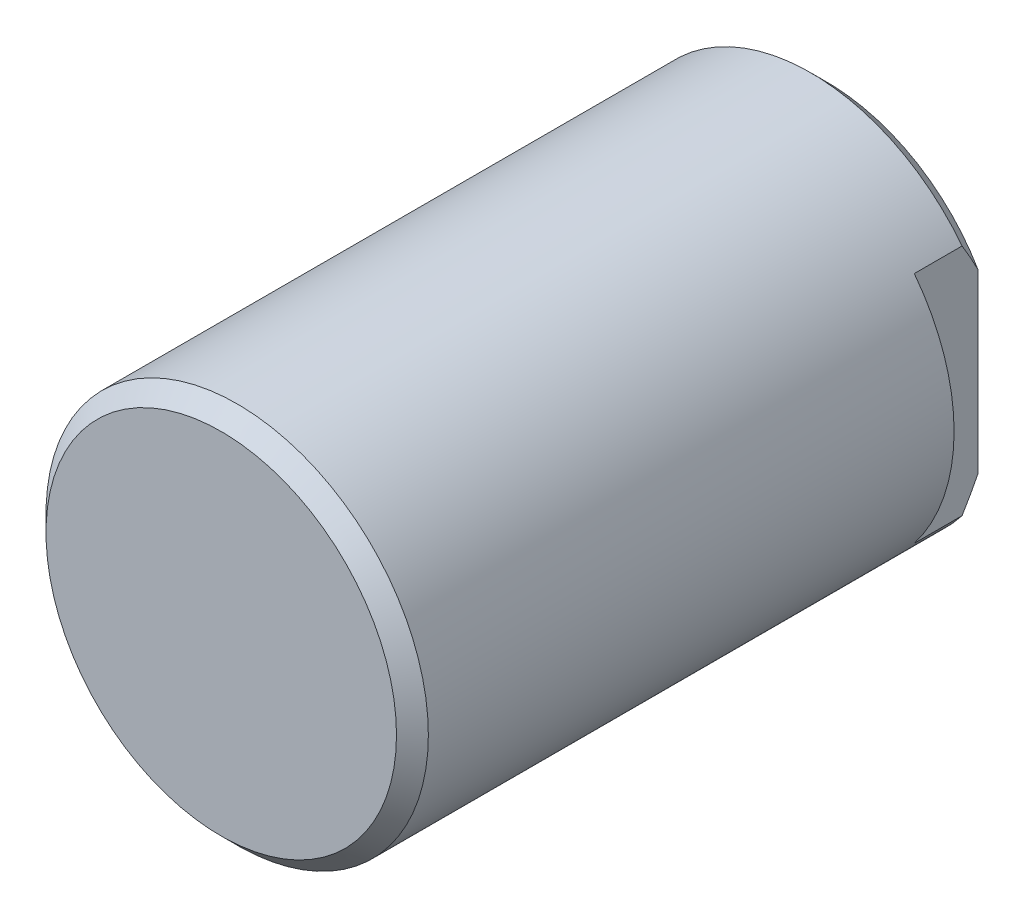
ISO-10303-21;
HEADER;
FILE_DESCRIPTION(('STEP AP214'),'2;1');
FILE_NAME('part.step','',(''),(''),'','','');
FILE_SCHEMA(('AUTOMOTIVE_DESIGN { 1 0 10303 214 1 1 1 1 }'));
ENDSEC;
DATA;
#1=APPLICATION_CONTEXT('core data for automotive mechanical design processes');
#2=APPLICATION_PROTOCOL_DEFINITION('international standard','automotive_design',2000,#1);
#3=PRODUCT_CONTEXT('',#1,'mechanical');
#4=PRODUCT('Part','Part','',(#3));
#5=PRODUCT_RELATED_PRODUCT_CATEGORY('part','',(#4));
#6=PRODUCT_DEFINITION_FORMATION('','',#4);
#7=PRODUCT_DEFINITION_CONTEXT('part definition',#1,'design');
#8=PRODUCT_DEFINITION('design','',#6,#7);
#9=PRODUCT_DEFINITION_SHAPE('','',#8);
#10=(LENGTH_UNIT() NAMED_UNIT(*) SI_UNIT(.MILLI.,.METRE.));
#11=(NAMED_UNIT(*) PLANE_ANGLE_UNIT() SI_UNIT($,.RADIAN.));
#12=(NAMED_UNIT(*) SI_UNIT($,.STERADIAN.) SOLID_ANGLE_UNIT());
#13=UNCERTAINTY_MEASURE_WITH_UNIT(LENGTH_MEASURE(1.E-05),#10,'distance_accuracy_value','');
#14=(GEOMETRIC_REPRESENTATION_CONTEXT(3) GLOBAL_UNCERTAINTY_ASSIGNED_CONTEXT((#13)) GLOBAL_UNIT_ASSIGNED_CONTEXT((#10,
#11,#12)) REPRESENTATION_CONTEXT('',''));
#15=CARTESIAN_POINT('',(0.,0.,0.));
#16=DIRECTION('',(0.,0.,1.));
#17=DIRECTION('',(1.,0.,0.));
#18=AXIS2_PLACEMENT_3D('',#15,#16,#17);
#19=CARTESIAN_POINT('',(0.,0.,0.));
#20=DIRECTION('',(0.,0.,1.));
#21=DIRECTION('',(1.,0.,0.));
#22=AXIS2_PLACEMENT_3D('',#19,#20,#21);
#23=CYLINDRICAL_SURFACE('',#22,6.);
#24=CARTESIAN_POINT('',(0.,0.,18.5));
#25=DIRECTION('',(0.,0.,1.));
#26=DIRECTION('',(1.,0.,0.));
#27=AXIS2_PLACEMENT_3D('',#24,#25,#26);
#28=CIRCLE('',#27,6.);
#29=CARTESIAN_POINT('',(6.,0.,18.5));
#30=VERTEX_POINT('',#29);
#31=EDGE_CURVE('E9',#30,#30,#28,.F.);
#32=ORIENTED_EDGE('',*,*,#31,.T.);
#33=EDGE_LOOP('',(#32));
#34=FACE_BOUND('',#33,.T.);
#35=DIRECTION('',(0.,0.,-1.));
#36=VECTOR('',#35,1.);
#37=CARTESIAN_POINT('',(-4.75,-3.6657195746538,2.));
#38=LINE('',#37,#36);
#39=CARTESIAN_POINT('',(-4.75,-3.6657195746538,2.));
#40=VERTEX_POINT('',#39);
#41=CARTESIAN_POINT('',(-4.75,-3.6657195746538,0.5));
#42=VERTEX_POINT('',#41);
#43=EDGE_CURVE('E180',#40,#42,#38,.T.);
#44=ORIENTED_EDGE('',*,*,#43,.T.);
#45=CARTESIAN_POINT('',(0.,0.,0.5));
#46=DIRECTION('',(0.,0.,-1.));
#47=DIRECTION('',(-1.,0.,0.));
#48=AXIS2_PLACEMENT_3D('',#45,#46,#47);
#49=CIRCLE('',#48,6.);
#50=CARTESIAN_POINT('',(4.75,-3.6657195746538,0.5));
#51=VERTEX_POINT('',#50);
#52=EDGE_CURVE('E175',#42,#51,#49,.F.);
#53=ORIENTED_EDGE('',*,*,#52,.T.);
#54=DIRECTION('',(0.,0.,-1.));
#55=VECTOR('',#54,1.);
#56=CARTESIAN_POINT('',(4.75,-3.6657195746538,2.));
#57=LINE('',#56,#55);
#58=CARTESIAN_POINT('',(4.75,-3.6657195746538,2.));
#59=VERTEX_POINT('',#58);
#60=EDGE_CURVE('E76',#59,#51,#57,.T.);
#61=ORIENTED_EDGE('',*,*,#60,.F.);
#62=CARTESIAN_POINT('',(0.,0.,2.));
#63=DIRECTION('',(0.,0.,-1.));
#64=DIRECTION('',(-1.,0.,0.));
#65=AXIS2_PLACEMENT_3D('',#62,#63,#64);
#66=CIRCLE('',#65,6.);
#67=CARTESIAN_POINT('',(4.75,3.6657195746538,2.));
#68=VERTEX_POINT('',#67);
#69=EDGE_CURVE('E81',#68,#59,#66,.T.);
#70=ORIENTED_EDGE('',*,*,#69,.F.);
#71=DIRECTION('',(0.,0.,-1.));
#72=VECTOR('',#71,1.);
#73=CARTESIAN_POINT('',(4.75,3.6657195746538,2.));
#74=LINE('',#73,#72);
#75=CARTESIAN_POINT('',(4.75,3.6657195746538,0.5));
#76=VERTEX_POINT('',#75);
#77=EDGE_CURVE('E66',#68,#76,#74,.T.);
#78=ORIENTED_EDGE('',*,*,#77,.T.);
#79=CARTESIAN_POINT('',(-4.75,3.6657195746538,0.5));
#80=VERTEX_POINT('',#79);
#81=EDGE_CURVE('E177',#76,#80,#49,.F.);
#82=ORIENTED_EDGE('',*,*,#81,.T.);
#83=DIRECTION('',(0.,0.,-1.));
#84=VECTOR('',#83,1.);
#85=CARTESIAN_POINT('',(-4.75,3.6657195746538,2.));
#86=LINE('',#85,#84);
#87=CARTESIAN_POINT('',(-4.75,3.6657195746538,2.));
#88=VERTEX_POINT('',#87);
#89=EDGE_CURVE('E36',#88,#80,#86,.T.);
#90=ORIENTED_EDGE('',*,*,#89,.F.);
#91=EDGE_CURVE('E86',#40,#88,#66,.T.);
#92=ORIENTED_EDGE('',*,*,#91,.F.);
#93=EDGE_LOOP('',(#44,#53,#61,#70,#78,#82,#90,#92));
#94=FACE_BOUND('',#93,.T.);
#95=ADVANCED_FACE('F14',(#34,#94),#23,.T.);
#96=CARTESIAN_POINT('',(0.,0.,0.));
#97=DIRECTION('',(0.,0.,-1.));
#98=DIRECTION('',(-1.,0.,0.));
#99=AXIS2_PLACEMENT_3D('',#96,#97,#98);
#100=PLANE('',#99);
#101=CARTESIAN_POINT('',(0.,0.,0.));
#102=DIRECTION('',(0.,0.,-1.));
#103=DIRECTION('',(-1.,0.,0.));
#104=AXIS2_PLACEMENT_3D('',#101,#102,#103);
#105=CIRCLE('',#104,5.5);
#106=CARTESIAN_POINT('',(4.75,-2.77263412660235,0.));
#107=VERTEX_POINT('',#106);
#108=CARTESIAN_POINT('',(-4.75,-2.77263412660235,0.));
#109=VERTEX_POINT('',#108);
#110=EDGE_CURVE('E174',#107,#109,#105,.T.);
#111=ORIENTED_EDGE('',*,*,#110,.T.);
#112=DIRECTION('',(0.,1.,0.));
#113=VECTOR('',#112,1.);
#114=CARTESIAN_POINT('',(-4.75,3.6657195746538,0.));
#115=LINE('',#114,#113);
#116=CARTESIAN_POINT('',(-4.75,2.77263412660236,0.));
#117=VERTEX_POINT('',#116);
#118=EDGE_CURVE('E82',#109,#117,#115,.T.);
#119=ORIENTED_EDGE('',*,*,#118,.T.);
#120=CARTESIAN_POINT('',(4.75,2.77263412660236,0.));
#121=VERTEX_POINT('',#120);
#122=EDGE_CURVE('E172',#117,#121,#105,.T.);
#123=ORIENTED_EDGE('',*,*,#122,.T.);
#124=DIRECTION('',(0.,-1.,0.));
#125=VECTOR('',#124,1.);
#126=CARTESIAN_POINT('',(4.75,3.6657195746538,0.));
#127=LINE('',#126,#125);
#128=EDGE_CURVE('E28',#121,#107,#127,.T.);
#129=ORIENTED_EDGE('',*,*,#128,.T.);
#130=EDGE_LOOP('',(#111,#119,#123,#129));
#131=FACE_BOUND('',#130,.T.);
#132=ADVANCED_FACE('F117',(#131),#100,.T.);
#133=CARTESIAN_POINT('',(0.,0.,0.));
#134=DIRECTION('',(0.,0.,1.));
#135=DIRECTION('',(1.,0.,0.));
#136=AXIS2_PLACEMENT_3D('',#133,#134,#135);
#137=CONICAL_SURFACE('',#136,5.5,0.785398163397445);
#138=ORIENTED_EDGE('',*,*,#52,.F.);
#139=CARTESIAN_POINT('',(-4.75,-7.89169974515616,3.71094049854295));
#140=CARTESIAN_POINT('',(-4.75,-7.69093683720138,3.53897428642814));
#141=CARTESIAN_POINT('',(-4.75,-7.48934475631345,3.36796190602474));
#142=CARTESIAN_POINT('',(-4.75,-7.08402963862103,3.02839521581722));
#143=CARTESIAN_POINT('',(-4.75,-6.88030615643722,2.85984143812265));
#144=CARTESIAN_POINT('',(-4.75,-6.46899973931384,2.52472348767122));
#145=CARTESIAN_POINT('',(-4.75,-6.26140027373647,2.35817954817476));
#146=CARTESIAN_POINT('',(-4.75,-5.84307115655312,2.02909534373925));
#147=CARTESIAN_POINT('',(-4.75,-5.63234177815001,1.86655473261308));
#148=CARTESIAN_POINT('',(-4.75,-5.21550995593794,1.55307966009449));
#149=CARTESIAN_POINT('',(-4.75,-5.00956146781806,1.40194123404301));
#150=CARTESIAN_POINT('',(-4.75,-4.59314137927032,1.10590470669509));
#151=CARTESIAN_POINT('',(-4.75,-4.38266891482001,0.961007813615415));
#152=CARTESIAN_POINT('',(-4.75,-3.95655813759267,0.679906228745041));
#153=CARTESIAN_POINT('',(-4.75,-3.74093088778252,0.543684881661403));
#154=CARTESIAN_POINT('',(-4.75,-3.30285613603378,0.282765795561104));
#155=CARTESIAN_POINT('',(-4.75,-3.08041196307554,0.158062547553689));
#156=CARTESIAN_POINT('',(-4.75,-2.6606770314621,-0.0580954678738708));
#157=CARTESIAN_POINT('',(-4.75,-2.46452403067,-0.151740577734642));
#158=CARTESIAN_POINT('',(-4.75,-2.06570924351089,-0.323383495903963));
#159=CARTESIAN_POINT('',(-4.75,-1.86305913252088,-0.401407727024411));
#160=CARTESIAN_POINT('',(-4.75,-1.55241999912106,-0.503726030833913));
#161=CARTESIAN_POINT('',(-4.75,-1.4469031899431,-0.535570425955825));
#162=CARTESIAN_POINT('',(-4.75,-1.23426699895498,-0.593326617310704));
#163=CARTESIAN_POINT('',(-4.75,-1.12714797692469,-0.619239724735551));
#164=CARTESIAN_POINT('',(-4.75,-0.910843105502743,-0.664618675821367));
#165=CARTESIAN_POINT('',(-4.75,-0.80164854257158,-0.684043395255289));
#166=CARTESIAN_POINT('',(-4.75,-0.582128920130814,-0.715704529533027));
#167=CARTESIAN_POINT('',(-4.75,-0.471802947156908,-0.727934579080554));
#168=CARTESIAN_POINT('',(-4.75,-0.361149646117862,-0.736290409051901));
#169=B_SPLINE_CURVE_WITH_KNOTS('',3,(#139,#140,#141,#142,#143,#144,#145,#146,#147,#148,#149,
#150,#151,#152,#153,#154,#155,#156,#157,#158,#159,#160,#161,#162,#163,#164,#165,#166,#167,#168),
.UNSPECIFIED.,.F.,.F.,(4,2,2,2,2,2,2,2,2,2,2,2,2,2,4),(0.,0.793044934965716,1.58625903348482,
2.38466300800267,3.18299769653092,3.94927751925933,4.71570501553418,5.48061377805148,
6.24515477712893,6.89676867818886,7.54727088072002,7.87778083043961,8.20821764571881,
8.54071074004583,8.87349755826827),.UNSPECIFIED.);
#170=EDGE_CURVE('E87',#42,#109,#169,.T.);
#171=ORIENTED_EDGE('',*,*,#170,.T.);
#172=ORIENTED_EDGE('',*,*,#110,.F.);
#173=CARTESIAN_POINT('',(4.75,-0.361149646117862,-0.736290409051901));
#174=CARTESIAN_POINT('',(4.75,-0.439189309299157,-0.730380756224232));
#175=CARTESIAN_POINT('',(4.75,-0.517068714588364,-0.722562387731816));
#176=CARTESIAN_POINT('',(4.75,-0.672351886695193,-0.703268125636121));
#177=CARTESIAN_POINT('',(4.75,-0.749755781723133,-0.691793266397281));
#178=CARTESIAN_POINT('',(4.75,-0.980739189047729,-0.652176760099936));
#179=CARTESIAN_POINT('',(4.75,-1.13344425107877,-0.618815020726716));
#180=CARTESIAN_POINT('',(4.75,-1.43384064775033,-0.540405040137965));
#181=CARTESIAN_POINT('',(4.75,-1.58156971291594,-0.495497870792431));
#182=CARTESIAN_POINT('',(4.75,-1.87363880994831,-0.395671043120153));
#183=CARTESIAN_POINT('',(4.75,-2.01797766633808,-0.340747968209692));
#184=CARTESIAN_POINT('',(4.75,-2.219389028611,-0.257355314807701));
#185=CARTESIAN_POINT('',(4.75,-2.27790796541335,-0.232302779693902));
#186=CARTESIAN_POINT('',(4.75,-2.39436332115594,-0.180907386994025));
#187=CARTESIAN_POINT('',(4.75,-2.45229986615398,-0.154564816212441));
#188=CARTESIAN_POINT('',(4.75,-2.56781660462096,-0.100595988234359));
#189=CARTESIAN_POINT('',(4.75,-2.62539485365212,-0.0729655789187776));
#190=CARTESIAN_POINT('',(4.75,-2.74000449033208,-0.0166031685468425));
#191=CARTESIAN_POINT('',(4.75,-2.79703590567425,0.0121287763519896));
#192=CARTESIAN_POINT('',(4.75,-3.08858543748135,0.162266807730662));
#193=CARTESIAN_POINT('',(4.75,-3.31894812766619,0.291793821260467));
#194=CARTESIAN_POINT('',(4.75,-3.77241352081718,0.563053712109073));
#195=CARTESIAN_POINT('',(4.75,-3.99551159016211,0.704794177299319));
#196=CARTESIAN_POINT('',(4.75,-4.43649667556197,0.997519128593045));
#197=CARTESIAN_POINT('',(4.75,-4.65436595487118,1.14853019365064));
#198=CARTESIAN_POINT('',(4.75,-5.08534212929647,1.4570537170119));
#199=CARTESIAN_POINT('',(4.75,-5.29845013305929,1.61456463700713));
#200=CARTESIAN_POINT('',(4.75,-5.71436758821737,1.92957970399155));
#201=CARTESIAN_POINT('',(4.75,-5.91729162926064,2.0869331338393));
#202=CARTESIAN_POINT('',(4.75,-6.3202903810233,2.40527179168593));
#203=CARTESIAN_POINT('',(4.75,-6.52036485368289,2.56625732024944));
#204=CARTESIAN_POINT('',(4.75,-6.91674689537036,2.88992607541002));
#205=CARTESIAN_POINT('',(4.75,-7.11307118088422,3.05258888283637));
#206=CARTESIAN_POINT('',(4.75,-7.50375445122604,3.38018460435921));
#207=CARTESIAN_POINT('',(4.75,-7.69811380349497,3.54511707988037));
#208=CARTESIAN_POINT('',(4.75,-7.89169974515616,3.71094049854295));
#209=B_SPLINE_CURVE_WITH_KNOTS('',3,(#173,#174,#175,#176,#177,#178,#179,#180,#181,#182,#183,
#184,#185,#186,#187,#188,#189,#190,#191,#192,#193,#194,#195,#196,#197,#198,#199,#200,#201,#202,
#203,#204,#205,#206,#207,#208),.UNSPECIFIED.,.F.,.F.,(4,2,2,2,2,2,2,2,2,2,2,2,2,2,2,2,2,4),(0.,
0.234738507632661,0.46941067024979,0.937694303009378,1.40050754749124,1.86347896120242,
2.05443728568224,2.24535334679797,2.43693447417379,2.62850584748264,3.42071585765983,
4.21342164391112,5.00851712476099,5.80342549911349,6.57372765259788,7.34409378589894,
8.10894205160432,8.87364454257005),.UNSPECIFIED.);
#210=EDGE_CURVE('E145',#107,#51,#209,.T.);
#211=ORIENTED_EDGE('',*,*,#210,.T.);
#212=EDGE_LOOP('',(#138,#171,#172,#211));
#213=FACE_BOUND('',#212,.T.);
#214=ADVANCED_FACE('F123',(#213),#137,.T.);
#215=ORIENTED_EDGE('',*,*,#122,.F.);
#216=CARTESIAN_POINT('',(-4.75,0.361149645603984,-0.736290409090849));
#217=CARTESIAN_POINT('',(-4.75,0.439189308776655,-0.73038075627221));
#218=CARTESIAN_POINT('',(-4.75,0.517068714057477,-0.722562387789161));
#219=CARTESIAN_POINT('',(-4.75,0.672351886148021,-0.703268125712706));
#220=CARTESIAN_POINT('',(-4.75,0.749755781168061,-0.691793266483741));
#221=CARTESIAN_POINT('',(-4.75,0.980739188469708,-0.652176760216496));
#222=CARTESIAN_POINT('',(-4.75,1.13344425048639,-0.618815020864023));
#223=CARTESIAN_POINT('',(-4.75,1.43384064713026,-0.540405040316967));
#224=CARTESIAN_POINT('',(-4.75,1.58156971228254,-0.495497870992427));
#225=CARTESIAN_POINT('',(-4.75,1.87363880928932,-0.395671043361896));
#226=CARTESIAN_POINT('',(-4.75,2.01797766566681,-0.340747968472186));
#227=CARTESIAN_POINT('',(-4.75,2.21938902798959,-0.257355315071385));
#228=CARTESIAN_POINT('',(-4.75,2.27790796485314,-0.232302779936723));
#229=CARTESIAN_POINT('',(-4.75,2.39436332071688,-0.180907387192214));
#230=CARTESIAN_POINT('',(-4.75,2.4522998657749,-0.154564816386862));
#231=CARTESIAN_POINT('',(-4.75,2.56781660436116,-0.100595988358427));
#232=CARTESIAN_POINT('',(-4.75,2.62539485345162,-0.0729655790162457));
#233=CARTESIAN_POINT('',(-4.75,2.74000449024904,-0.0166031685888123));
#234=CARTESIAN_POINT('',(-4.75,2.79703590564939,0.0121287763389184));
#235=CARTESIAN_POINT('',(-4.75,3.08858543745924,0.16226680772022));
#236=CARTESIAN_POINT('',(-4.75,3.3189481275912,0.291793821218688));
#237=CARTESIAN_POINT('',(-4.75,3.77241352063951,0.563053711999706));
#238=CARTESIAN_POINT('',(-4.75,3.99551158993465,0.704794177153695));
#239=CARTESIAN_POINT('',(-4.75,4.43649667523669,0.997519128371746));
#240=CARTESIAN_POINT('',(-4.75,4.65436595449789,1.1485301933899));
#241=CARTESIAN_POINT('',(-4.75,5.08534212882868,1.45705371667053));
#242=CARTESIAN_POINT('',(-4.75,5.29845013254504,1.61456463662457));
#243=CARTESIAN_POINT('',(-4.75,5.71436758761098,1.92957970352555));
#244=CARTESIAN_POINT('',(-4.75,5.9172916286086,2.08693313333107));
#245=CARTESIAN_POINT('',(-4.75,6.32029038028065,2.40527179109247));
#246=CARTESIAN_POINT('',(-4.75,6.52036485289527,2.566257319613));
#247=CARTESIAN_POINT('',(-4.75,6.91674689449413,2.88992607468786));
#248=CARTESIAN_POINT('',(-4.75,7.11307117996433,3.05258888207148));
#249=CARTESIAN_POINT('',(-4.75,7.50375445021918,3.38018460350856));
#250=CARTESIAN_POINT('',(-4.75,7.69811380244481,3.5451170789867));
#251=CARTESIAN_POINT('',(-4.75,7.89169974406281,3.71094049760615));
#252=B_SPLINE_CURVE_WITH_KNOTS('',3,(#216,#217,#218,#219,#220,#221,#222,#223,#224,#225,#226,
#227,#228,#229,#230,#231,#232,#233,#234,#235,#236,#237,#238,#239,#240,#241,#242,#243,#244,#245,
#246,#247,#248,#249,#250,#251),.UNSPECIFIED.,.F.,.F.,(4,2,2,2,2,2,2,2,2,2,2,2,2,2,2,2,2,4),(0.,
0.234738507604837,0.469410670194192,0.93769430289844,1.40050754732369,1.8634789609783,
2.05443728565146,2.24535334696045,2.43693447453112,2.62850584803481,3.42071585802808,
4.21342164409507,5.00851712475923,5.80342549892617,6.57372765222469,7.34409378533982,
8.10894205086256,8.87364454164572),.UNSPECIFIED.);
#253=EDGE_CURVE('E90',#117,#80,#252,.T.);
#254=ORIENTED_EDGE('',*,*,#253,.T.);
#255=ORIENTED_EDGE('',*,*,#81,.F.);
#256=CARTESIAN_POINT('',(4.75,7.8916997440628,3.71094049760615));
#257=CARTESIAN_POINT('',(4.75,7.69093683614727,3.53897428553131));
#258=CARTESIAN_POINT('',(4.75,7.48934475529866,3.36796190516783));
#259=CARTESIAN_POINT('',(4.75,7.08402963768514,3.02839521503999));
#260=CARTESIAN_POINT('',(4.75,6.88030615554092,2.85984143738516));
#261=CARTESIAN_POINT('',(4.75,6.46899973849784,2.52472348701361));
#262=CARTESIAN_POINT('',(4.75,6.26140027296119,2.35817954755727));
#263=CARTESIAN_POINT('',(4.75,5.84307115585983,2.02909534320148));
#264=CARTESIAN_POINT('',(4.75,5.63234177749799,1.86655473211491));
#265=CARTESIAN_POINT('',(4.75,5.21550995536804,1.55307965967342));
#266=CARTESIAN_POINT('',(4.75,5.00956146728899,1.40194123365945));
#267=CARTESIAN_POINT('',(4.75,4.5931413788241,1.10590470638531));
#268=CARTESIAN_POINT('',(4.75,4.38266891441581,0.961007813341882));
#269=CARTESIAN_POINT('',(4.75,3.95655813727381,0.679906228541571));
#270=CARTESIAN_POINT('',(4.75,3.74093088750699,0.543684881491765));
#271=CARTESIAN_POINT('',(4.75,3.30285613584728,0.282765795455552));
#272=CARTESIAN_POINT('',(4.75,3.08041196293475,0.158062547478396));
#273=CARTESIAN_POINT('',(4.75,2.6606770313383,-0.0580954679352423));
#274=CARTESIAN_POINT('',(4.75,2.4645240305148,-0.151740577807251));
#275=CARTESIAN_POINT('',(4.75,2.06570924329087,-0.323383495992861));
#276=CARTESIAN_POINT('',(4.75,1.86305913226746,-0.401407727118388));
#277=CARTESIAN_POINT('',(4.75,1.55241999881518,-0.503726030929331));
#278=CARTESIAN_POINT('',(4.75,1.44690318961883,-0.535570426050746));
#279=CARTESIAN_POINT('',(4.75,1.23426699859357,-0.593326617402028));
#280=CARTESIAN_POINT('',(4.75,1.12714797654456,-0.619239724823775));
#281=CARTESIAN_POINT('',(4.75,0.910843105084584,-0.664618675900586));
#282=CARTESIAN_POINT('',(4.75,0.801648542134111,-0.684043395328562));
#283=CARTESIAN_POINT('',(4.75,0.582128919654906,-0.715704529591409));
#284=CARTESIAN_POINT('',(4.75,0.471802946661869,-0.727934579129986));
#285=CARTESIAN_POINT('',(4.75,0.361149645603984,-0.736290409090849));
#286=B_SPLINE_CURVE_WITH_KNOTS('',3,(#256,#257,#258,#259,#260,#261,#262,#263,#264,#265,#266,
#267,#268,#269,#270,#271,#272,#273,#274,#275,#276,#277,#278,#279,#280,#281,#282,#283,#284,#285),
.UNSPECIFIED.,.F.,.F.,(4,2,2,2,2,2,2,2,2,2,2,2,2,2,4),(0.,0.793044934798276,1.58625903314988,
2.38466300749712,3.18299769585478,3.94927751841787,4.71570501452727,5.48061377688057,
6.2451547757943,6.89676867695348,7.54727087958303,7.87778082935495,8.20821764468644,
8.5407107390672,8.87349755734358),.UNSPECIFIED.);
#287=EDGE_CURVE('E71',#76,#121,#286,.T.);
#288=ORIENTED_EDGE('',*,*,#287,.T.);
#289=EDGE_LOOP('',(#215,#254,#255,#288));
#290=FACE_BOUND('',#289,.T.);
#291=ADVANCED_FACE('F129',(#290),#137,.T.);
#292=CARTESIAN_POINT('',(4.75,3.6657195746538,2.));
#293=DIRECTION('',(1.,0.,0.));
#294=DIRECTION('',(0.,-1.,0.));
#295=AXIS2_PLACEMENT_3D('',#292,#293,#294);
#296=PLANE('',#295);
#297=ORIENTED_EDGE('',*,*,#128,.F.);
#298=ORIENTED_EDGE('',*,*,#287,.F.);
#299=ORIENTED_EDGE('',*,*,#77,.F.);
#300=DIRECTION('',(0.,-1.,0.));
#301=VECTOR('',#300,1.);
#302=CARTESIAN_POINT('',(4.75,3.6657195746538,2.));
#303=LINE('',#302,#301);
#304=EDGE_CURVE('E69',#68,#59,#303,.T.);
#305=ORIENTED_EDGE('',*,*,#304,.T.);
#306=ORIENTED_EDGE('',*,*,#60,.T.);
#307=ORIENTED_EDGE('',*,*,#210,.F.);
#308=EDGE_LOOP('',(#297,#298,#299,#305,#306,#307));
#309=FACE_BOUND('',#308,.T.);
#310=ADVANCED_FACE('F68',(#309),#296,.T.);
#311=CARTESIAN_POINT('',(0.,0.,2.));
#312=DIRECTION('',(0.,0.,-1.));
#313=DIRECTION('',(-1.,0.,0.));
#314=AXIS2_PLACEMENT_3D('',#311,#312,#313);
#315=PLANE('',#314);
#316=ORIENTED_EDGE('',*,*,#69,.T.);
#317=ORIENTED_EDGE('',*,*,#304,.F.);
#318=EDGE_LOOP('',(#316,#317));
#319=FACE_BOUND('',#318,.T.);
#320=ADVANCED_FACE('F80',(#319),#315,.T.);
#321=ORIENTED_EDGE('',*,*,#91,.T.);
#322=DIRECTION('',(0.,1.,0.));
#323=VECTOR('',#322,1.);
#324=CARTESIAN_POINT('',(-4.75,3.6657195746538,2.));
#325=LINE('',#324,#323);
#326=EDGE_CURVE('E77',#40,#88,#325,.T.);
#327=ORIENTED_EDGE('',*,*,#326,.F.);
#328=EDGE_LOOP('',(#321,#327));
#329=FACE_BOUND('',#328,.T.);
#330=ADVANCED_FACE('F156',(#329),#315,.T.);
#331=CARTESIAN_POINT('',(-4.75,3.6657195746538,2.));
#332=DIRECTION('',(-1.,0.,0.));
#333=DIRECTION('',(0.,1.,0.));
#334=AXIS2_PLACEMENT_3D('',#331,#332,#333);
#335=PLANE('',#334);
#336=ORIENTED_EDGE('',*,*,#43,.F.);
#337=ORIENTED_EDGE('',*,*,#326,.T.);
#338=ORIENTED_EDGE('',*,*,#89,.T.);
#339=ORIENTED_EDGE('',*,*,#253,.F.);
#340=ORIENTED_EDGE('',*,*,#118,.F.);
#341=ORIENTED_EDGE('',*,*,#170,.F.);
#342=EDGE_LOOP('',(#336,#337,#338,#339,#340,#341));
#343=FACE_BOUND('',#342,.T.);
#344=ADVANCED_FACE('F113',(#343),#335,.T.);
#345=CARTESIAN_POINT('',(0.,0.,19.));
#346=DIRECTION('',(0.,0.,1.));
#347=DIRECTION('',(1.,0.,0.));
#348=AXIS2_PLACEMENT_3D('',#345,#346,#347);
#349=PLANE('',#348);
#350=CARTESIAN_POINT('',(0.,0.,19.));
#351=DIRECTION('',(0.,0.,1.));
#352=DIRECTION('',(1.,0.,0.));
#353=AXIS2_PLACEMENT_3D('',#350,#351,#352);
#354=CIRCLE('',#353,5.5);
#355=CARTESIAN_POINT('',(5.5,0.,19.));
#356=VERTEX_POINT('',#355);
#357=EDGE_CURVE('E21',#356,#356,#354,.T.);
#358=ORIENTED_EDGE('',*,*,#357,.T.);
#359=EDGE_LOOP('',(#358));
#360=FACE_BOUND('',#359,.T.);
#361=ADVANCED_FACE('F102',(#360),#349,.T.);
#362=CARTESIAN_POINT('',(0.,0.,19.));
#363=DIRECTION('',(0.,0.,-1.));
#364=DIRECTION('',(-1.,0.,0.));
#365=AXIS2_PLACEMENT_3D('',#362,#363,#364);
#366=CONICAL_SURFACE('',#365,5.5,0.785398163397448);
#367=ORIENTED_EDGE('',*,*,#31,.F.);
#368=EDGE_LOOP('',(#367));
#369=FACE_BOUND('',#368,.T.);
#370=ORIENTED_EDGE('',*,*,#357,.F.);
#371=EDGE_LOOP('',(#370));
#372=FACE_BOUND('',#371,.T.);
#373=ADVANCED_FACE('F104',(#369,#372),#366,.T.);
#374=CLOSED_SHELL('',(#95,#132,#214,#291,#310,#320,#330,#344,#361,#373));
#375=MANIFOLD_SOLID_BREP('B1',#374);
#376=ADVANCED_BREP_SHAPE_REPRESENTATION('',(#18,#375),#14);
#377=SHAPE_DEFINITION_REPRESENTATION(#9,#376);
ENDSEC;
END-ISO-10303-21;
